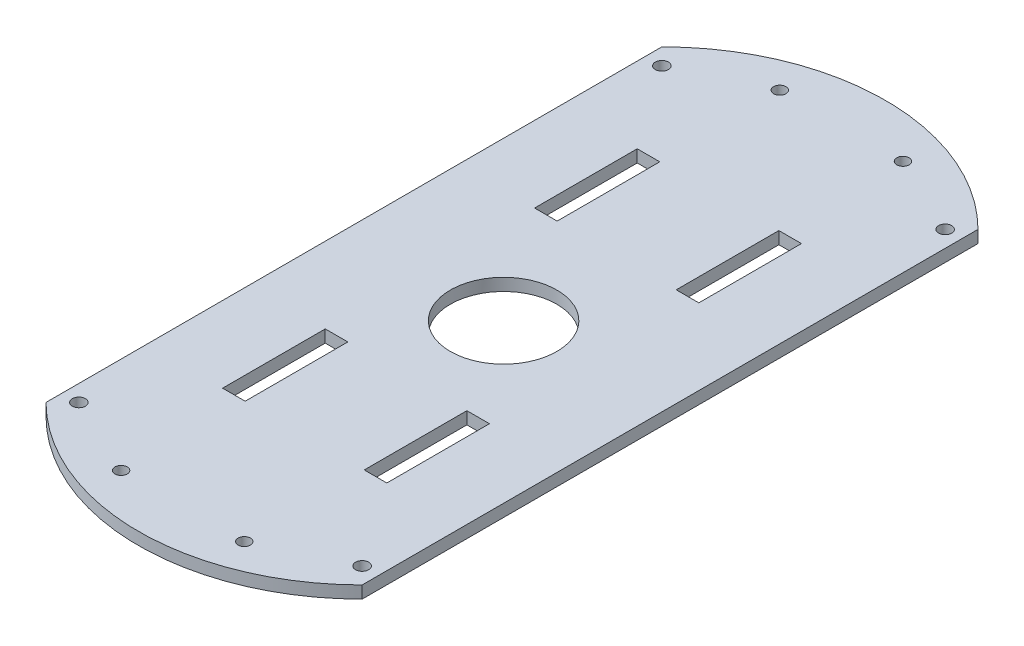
ISO-10303-21;
HEADER;
FILE_DESCRIPTION(('STEP AP214'),'2;1');
FILE_NAME('part.step','',(''),(''),'','','');
FILE_SCHEMA(('AUTOMOTIVE_DESIGN { 1 0 10303 214 1 1 1 1 }'));
ENDSEC;
DATA;
#1=APPLICATION_CONTEXT('core data for automotive mechanical design processes');
#2=APPLICATION_PROTOCOL_DEFINITION('international standard','automotive_design',2000,#1);
#3=PRODUCT_CONTEXT('',#1,'mechanical');
#4=PRODUCT('Part','Part','',(#3));
#5=PRODUCT_RELATED_PRODUCT_CATEGORY('part','',(#4));
#6=PRODUCT_DEFINITION_FORMATION('','',#4);
#7=PRODUCT_DEFINITION_CONTEXT('part definition',#1,'design');
#8=PRODUCT_DEFINITION('design','',#6,#7);
#9=PRODUCT_DEFINITION_SHAPE('','',#8);
#10=(LENGTH_UNIT() NAMED_UNIT(*) SI_UNIT(.MILLI.,.METRE.));
#11=(NAMED_UNIT(*) PLANE_ANGLE_UNIT() SI_UNIT($,.RADIAN.));
#12=(NAMED_UNIT(*) SI_UNIT($,.STERADIAN.) SOLID_ANGLE_UNIT());
#13=UNCERTAINTY_MEASURE_WITH_UNIT(LENGTH_MEASURE(1.E-05),#10,'distance_accuracy_value','');
#14=(GEOMETRIC_REPRESENTATION_CONTEXT(3) GLOBAL_UNCERTAINTY_ASSIGNED_CONTEXT((#13)) GLOBAL_UNIT_ASSIGNED_CONTEXT((#10,
#11,#12)) REPRESENTATION_CONTEXT('',''));
#15=CARTESIAN_POINT('',(0.,0.,0.));
#16=DIRECTION('',(0.,0.,1.));
#17=DIRECTION('',(1.,0.,0.));
#18=AXIS2_PLACEMENT_3D('',#15,#16,#17);
#19=CARTESIAN_POINT('',(38.5,3.,38.5000000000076));
#20=DIRECTION('',(0.,-1.,0.));
#21=DIRECTION('',(0.,0.,-1.));
#22=AXIS2_PLACEMENT_3D('',#19,#20,#21);
#23=CYLINDRICAL_SURFACE('',#22,54.4472221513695);
#24=CARTESIAN_POINT('',(38.5,0.,38.5000000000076));
#25=DIRECTION('',(0.,1.,0.));
#26=DIRECTION('',(0.,0.,-1.));
#27=AXIS2_PLACEMENT_3D('',#24,#25,#26);
#28=CIRCLE('',#27,54.4472221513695);
#29=CARTESIAN_POINT('',(77.,0.,0.));
#30=VERTEX_POINT('',#29);
#31=CARTESIAN_POINT('',(0.,0.,0.));
#32=VERTEX_POINT('',#31);
#33=EDGE_CURVE('E305',#30,#32,#28,.T.);
#34=ORIENTED_EDGE('',*,*,#33,.T.);
#35=DIRECTION('',(0.,-1.,0.));
#36=VECTOR('',#35,1.);
#37=CARTESIAN_POINT('',(0.,3.,0.));
#38=LINE('',#37,#36);
#39=CARTESIAN_POINT('',(0.,3.,0.));
#40=VERTEX_POINT('',#39);
#41=EDGE_CURVE('E321',#40,#32,#38,.T.);
#42=ORIENTED_EDGE('',*,*,#41,.F.);
#43=CARTESIAN_POINT('',(38.5,3.,38.5000000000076));
#44=DIRECTION('',(0.,1.,0.));
#45=DIRECTION('',(0.,0.,-1.));
#46=AXIS2_PLACEMENT_3D('',#43,#44,#45);
#47=CIRCLE('',#46,54.4472221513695);
#48=CARTESIAN_POINT('',(77.,3.,0.));
#49=VERTEX_POINT('',#48);
#50=EDGE_CURVE('E294',#49,#40,#47,.T.);
#51=ORIENTED_EDGE('',*,*,#50,.F.);
#52=DIRECTION('',(0.,-1.,0.));
#53=VECTOR('',#52,1.);
#54=CARTESIAN_POINT('',(77.,3.,0.));
#55=LINE('',#54,#53);
#56=EDGE_CURVE('E304',#49,#30,#55,.T.);
#57=ORIENTED_EDGE('',*,*,#56,.T.);
#58=EDGE_LOOP('',(#34,#42,#51,#57));
#59=FACE_BOUND('',#58,.T.);
#60=ADVANCED_FACE('F33',(#59),#23,.T.);
#61=CARTESIAN_POINT('',(0.,3.,0.));
#62=DIRECTION('',(1.,0.,0.));
#63=DIRECTION('',(0.,0.,-1.));
#64=AXIS2_PLACEMENT_3D('',#61,#62,#63);
#65=PLANE('',#64);
#66=DIRECTION('',(0.,0.,1.));
#67=VECTOR('',#66,1.);
#68=CARTESIAN_POINT('',(0.,0.,0.));
#69=LINE('',#68,#67);
#70=CARTESIAN_POINT('',(0.,0.,150.));
#71=VERTEX_POINT('',#70);
#72=EDGE_CURVE('E308',#32,#71,#69,.T.);
#73=ORIENTED_EDGE('',*,*,#72,.T.);
#74=DIRECTION('',(0.,-1.,0.));
#75=VECTOR('',#74,1.);
#76=CARTESIAN_POINT('',(0.,3.,150.));
#77=LINE('',#76,#75);
#78=CARTESIAN_POINT('',(0.,3.,150.));
#79=VERTEX_POINT('',#78);
#80=EDGE_CURVE('E318',#79,#71,#77,.T.);
#81=ORIENTED_EDGE('',*,*,#80,.F.);
#82=DIRECTION('',(0.,0.,1.));
#83=VECTOR('',#82,1.);
#84=CARTESIAN_POINT('',(0.,3.,0.));
#85=LINE('',#84,#83);
#86=EDGE_CURVE('E297',#40,#79,#85,.T.);
#87=ORIENTED_EDGE('',*,*,#86,.F.);
#88=ORIENTED_EDGE('',*,*,#41,.T.);
#89=EDGE_LOOP('',(#73,#81,#87,#88));
#90=FACE_BOUND('',#89,.T.);
#91=ADVANCED_FACE('F429',(#90),#65,.F.);
#92=CARTESIAN_POINT('',(38.5,3.,111.5));
#93=DIRECTION('',(0.,-1.,0.));
#94=DIRECTION('',(0.,0.,-1.));
#95=AXIS2_PLACEMENT_3D('',#92,#93,#94);
#96=CYLINDRICAL_SURFACE('',#95,54.4472221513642);
#97=CARTESIAN_POINT('',(38.5,0.,111.5));
#98=DIRECTION('',(0.,1.,0.));
#99=DIRECTION('',(0.,0.,-1.));
#100=AXIS2_PLACEMENT_3D('',#97,#98,#99);
#101=CIRCLE('',#100,54.4472221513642);
#102=CARTESIAN_POINT('',(77.,0.,150.));
#103=VERTEX_POINT('',#102);
#104=EDGE_CURVE('E310',#71,#103,#101,.T.);
#105=ORIENTED_EDGE('',*,*,#104,.T.);
#106=DIRECTION('',(0.,-1.,0.));
#107=VECTOR('',#106,1.);
#108=CARTESIAN_POINT('',(77.,3.,150.));
#109=LINE('',#108,#107);
#110=CARTESIAN_POINT('',(77.,3.,150.));
#111=VERTEX_POINT('',#110);
#112=EDGE_CURVE('E315',#111,#103,#109,.T.);
#113=ORIENTED_EDGE('',*,*,#112,.F.);
#114=CARTESIAN_POINT('',(38.5,3.,111.5));
#115=DIRECTION('',(0.,1.,0.));
#116=DIRECTION('',(0.,0.,-1.));
#117=AXIS2_PLACEMENT_3D('',#114,#115,#116);
#118=CIRCLE('',#117,54.4472221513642);
#119=EDGE_CURVE('E300',#79,#111,#118,.T.);
#120=ORIENTED_EDGE('',*,*,#119,.F.);
#121=ORIENTED_EDGE('',*,*,#80,.T.);
#122=EDGE_LOOP('',(#105,#113,#120,#121));
#123=FACE_BOUND('',#122,.T.);
#124=ADVANCED_FACE('F434',(#123),#96,.T.);
#125=CARTESIAN_POINT('',(77.,3.,0.));
#126=DIRECTION('',(-1.,0.,0.));
#127=DIRECTION('',(0.,0.,1.));
#128=AXIS2_PLACEMENT_3D('',#125,#126,#127);
#129=PLANE('',#128);
#130=DIRECTION('',(0.,0.,-1.));
#131=VECTOR('',#130,1.);
#132=CARTESIAN_POINT('',(77.,0.,0.));
#133=LINE('',#132,#131);
#134=EDGE_CURVE('E298',#103,#30,#133,.T.);
#135=ORIENTED_EDGE('',*,*,#134,.T.);
#136=ORIENTED_EDGE('',*,*,#56,.F.);
#137=DIRECTION('',(0.,0.,-1.));
#138=VECTOR('',#137,1.);
#139=CARTESIAN_POINT('',(77.,3.,0.));
#140=LINE('',#139,#138);
#141=EDGE_CURVE('E302',#111,#49,#140,.T.);
#142=ORIENTED_EDGE('',*,*,#141,.F.);
#143=ORIENTED_EDGE('',*,*,#112,.T.);
#144=EDGE_LOOP('',(#135,#136,#142,#143));
#145=FACE_BOUND('',#144,.T.);
#146=ADVANCED_FACE('F394',(#145),#129,.F.);
#147=CARTESIAN_POINT('',(38.5,3.,38.5000000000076));
#148=DIRECTION('',(0.,-1.,0.));
#149=DIRECTION('',(0.,0.,-1.));
#150=AXIS2_PLACEMENT_3D('',#147,#148,#149);
#151=PLANE('',#150);
#152=DIRECTION('',(1.,0.,0.));
#153=VECTOR('',#152,1.);
#154=CARTESIAN_POINT('',(53.,3.,125.49));
#155=LINE('',#154,#153);
#156=CARTESIAN_POINT('',(53.,3.,125.49));
#157=VERTEX_POINT('',#156);
#158=CARTESIAN_POINT('',(58.5,3.,125.49));
#159=VERTEX_POINT('',#158);
#160=EDGE_CURVE('E196',#157,#159,#155,.T.);
#161=ORIENTED_EDGE('',*,*,#160,.F.);
#162=DIRECTION('',(0.,0.,1.));
#163=VECTOR('',#162,1.);
#164=CARTESIAN_POINT('',(53.,3.,125.49));
#165=LINE('',#164,#163);
#166=CARTESIAN_POINT('',(53.,3.,100.49));
#167=VERTEX_POINT('',#166);
#168=EDGE_CURVE('E48',#167,#157,#165,.T.);
#169=ORIENTED_EDGE('',*,*,#168,.F.);
#170=DIRECTION('',(-1.,0.,0.));
#171=VECTOR('',#170,1.);
#172=CARTESIAN_POINT('',(53.,3.,100.49));
#173=LINE('',#172,#171);
#174=CARTESIAN_POINT('',(58.5,3.,100.49));
#175=VERTEX_POINT('',#174);
#176=EDGE_CURVE('E187',#175,#167,#173,.T.);
#177=ORIENTED_EDGE('',*,*,#176,.F.);
#178=DIRECTION('',(0.,0.,-1.));
#179=VECTOR('',#178,1.);
#180=CARTESIAN_POINT('',(58.5,3.,125.49));
#181=LINE('',#180,#179);
#182=EDGE_CURVE('E190',#159,#175,#181,.T.);
#183=ORIENTED_EDGE('',*,*,#182,.F.);
#184=EDGE_LOOP('',(#161,#169,#177,#183));
#185=FACE_BOUND('',#184,.T.);
#186=CARTESIAN_POINT('',(23.5,3.,-5.21799999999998));
#187=DIRECTION('',(0.,1.,0.));
#188=DIRECTION('',(0.,0.,1.));
#189=AXIS2_PLACEMENT_3D('',#186,#187,#188);
#190=CIRCLE('',#189,1.5);
#191=CARTESIAN_POINT('',(23.5,3.,-3.71799999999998));
#192=VERTEX_POINT('',#191);
#193=EDGE_CURVE('E209',#192,#192,#190,.T.);
#194=ORIENTED_EDGE('',*,*,#193,.F.);
#195=EDGE_LOOP('',(#194));
#196=FACE_BOUND('',#195,.T.);
#197=DIRECTION('',(1.,0.,0.));
#198=VECTOR('',#197,1.);
#199=CARTESIAN_POINT('',(18.5,3.,125.49));
#200=LINE('',#199,#198);
#201=CARTESIAN_POINT('',(18.5,3.,125.49));
#202=VERTEX_POINT('',#201);
#203=CARTESIAN_POINT('',(24.,3.,125.49));
#204=VERTEX_POINT('',#203);
#205=EDGE_CURVE('E219',#202,#204,#200,.T.);
#206=ORIENTED_EDGE('',*,*,#205,.F.);
#207=DIRECTION('',(0.,0.,1.));
#208=VECTOR('',#207,1.);
#209=CARTESIAN_POINT('',(18.5,3.,100.49));
#210=LINE('',#209,#208);
#211=CARTESIAN_POINT('',(18.5,3.,100.49));
#212=VERTEX_POINT('',#211);
#213=EDGE_CURVE('E217',#212,#202,#210,.T.);
#214=ORIENTED_EDGE('',*,*,#213,.F.);
#215=DIRECTION('',(-1.,0.,0.));
#216=VECTOR('',#215,1.);
#217=CARTESIAN_POINT('',(18.5,3.,100.49));
#218=LINE('',#217,#216);
#219=CARTESIAN_POINT('',(24.,3.,100.49));
#220=VERTEX_POINT('',#219);
#221=EDGE_CURVE('E225',#220,#212,#218,.T.);
#222=ORIENTED_EDGE('',*,*,#221,.F.);
#223=DIRECTION('',(0.,0.,-1.));
#224=VECTOR('',#223,1.);
#225=CARTESIAN_POINT('',(24.,3.,100.49));
#226=LINE('',#225,#224);
#227=EDGE_CURVE('E222',#204,#220,#226,.T.);
#228=ORIENTED_EDGE('',*,*,#227,.F.);
#229=EDGE_LOOP('',(#206,#214,#222,#228));
#230=FACE_BOUND('',#229,.T.);
#231=CARTESIAN_POINT('',(53.5,3.,-5.21799999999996));
#232=DIRECTION('',(0.,1.,0.));
#233=DIRECTION('',(0.,0.,1.));
#234=AXIS2_PLACEMENT_3D('',#231,#232,#233);
#235=CIRCLE('',#234,1.5);
#236=CARTESIAN_POINT('',(53.5,3.,-3.71799999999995));
#237=VERTEX_POINT('',#236);
#238=EDGE_CURVE('E206',#237,#237,#235,.T.);
#239=ORIENTED_EDGE('',*,*,#238,.F.);
#240=EDGE_LOOP('',(#239));
#241=FACE_BOUND('',#240,.T.);
#242=CARTESIAN_POINT('',(23.5,3.,155.208));
#243=DIRECTION('',(0.,1.,0.));
#244=DIRECTION('',(0.,0.,1.));
#245=AXIS2_PLACEMENT_3D('',#242,#243,#244);
#246=CIRCLE('',#245,1.5);
#247=CARTESIAN_POINT('',(23.5,3.,156.708));
#248=VERTEX_POINT('',#247);
#249=EDGE_CURVE('E210',#248,#248,#246,.T.);
#250=ORIENTED_EDGE('',*,*,#249,.F.);
#251=EDGE_LOOP('',(#250));
#252=FACE_BOUND('',#251,.T.);
#253=CARTESIAN_POINT('',(53.5,3.,155.208));
#254=DIRECTION('',(0.,1.,0.));
#255=DIRECTION('',(0.,0.,1.));
#256=AXIS2_PLACEMENT_3D('',#253,#254,#255);
#257=CIRCLE('',#256,1.5);
#258=CARTESIAN_POINT('',(53.5,3.,156.708));
#259=VERTEX_POINT('',#258);
#260=EDGE_CURVE('E202',#259,#259,#257,.T.);
#261=ORIENTED_EDGE('',*,*,#260,.F.);
#262=EDGE_LOOP('',(#261));
#263=FACE_BOUND('',#262,.T.);
#264=CARTESIAN_POINT('',(4.,3.,146.));
#265=DIRECTION('',(0.,1.,0.));
#266=DIRECTION('',(0.,0.,1.));
#267=AXIS2_PLACEMENT_3D('',#264,#265,#266);
#268=CIRCLE('',#267,1.6);
#269=CARTESIAN_POINT('',(4.,3.,147.6));
#270=VERTEX_POINT('',#269);
#271=EDGE_CURVE('E241',#270,#270,#268,.T.);
#272=ORIENTED_EDGE('',*,*,#271,.F.);
#273=EDGE_LOOP('',(#272));
#274=FACE_BOUND('',#273,.T.);
#275=CARTESIAN_POINT('',(73.,3.,4.));
#276=DIRECTION('',(0.,1.,0.));
#277=DIRECTION('',(0.,0.,1.));
#278=AXIS2_PLACEMENT_3D('',#275,#276,#277);
#279=CIRCLE('',#278,1.60000000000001);
#280=CARTESIAN_POINT('',(73.,3.,5.6));
#281=VERTEX_POINT('',#280);
#282=EDGE_CURVE('E281',#281,#281,#279,.T.);
#283=ORIENTED_EDGE('',*,*,#282,.F.);
#284=EDGE_LOOP('',(#283));
#285=FACE_BOUND('',#284,.T.);
#286=CARTESIAN_POINT('',(4.,3.,4.));
#287=DIRECTION('',(0.,1.,0.));
#288=DIRECTION('',(0.,0.,1.));
#289=AXIS2_PLACEMENT_3D('',#286,#287,#288);
#290=CIRCLE('',#289,1.6);
#291=CARTESIAN_POINT('',(4.,3.,5.6));
#292=VERTEX_POINT('',#291);
#293=EDGE_CURVE('E284',#292,#292,#290,.T.);
#294=ORIENTED_EDGE('',*,*,#293,.F.);
#295=EDGE_LOOP('',(#294));
#296=FACE_BOUND('',#295,.T.);
#297=CARTESIAN_POINT('',(73.,3.,146.));
#298=DIRECTION('',(0.,1.,0.));
#299=DIRECTION('',(0.,0.,1.));
#300=AXIS2_PLACEMENT_3D('',#297,#298,#299);
#301=CIRCLE('',#300,1.6);
#302=CARTESIAN_POINT('',(73.,3.,147.6));
#303=VERTEX_POINT('',#302);
#304=EDGE_CURVE('E238',#303,#303,#301,.T.);
#305=ORIENTED_EDGE('',*,*,#304,.F.);
#306=EDGE_LOOP('',(#305));
#307=FACE_BOUND('',#306,.T.);
#308=DIRECTION('',(1.,0.,0.));
#309=VECTOR('',#308,1.);
#310=CARTESIAN_POINT('',(18.5,3.,49.5));
#311=LINE('',#310,#309);
#312=CARTESIAN_POINT('',(18.5,3.,49.5));
#313=VERTEX_POINT('',#312);
#314=CARTESIAN_POINT('',(24.,3.,49.5));
#315=VERTEX_POINT('',#314);
#316=EDGE_CURVE('E245',#313,#315,#311,.T.);
#317=ORIENTED_EDGE('',*,*,#316,.F.);
#318=DIRECTION('',(0.,0.,1.));
#319=VECTOR('',#318,1.);
#320=CARTESIAN_POINT('',(18.5,3.,24.5));
#321=LINE('',#320,#319);
#322=CARTESIAN_POINT('',(18.5,3.,24.5));
#323=VERTEX_POINT('',#322);
#324=EDGE_CURVE('E243',#323,#313,#321,.T.);
#325=ORIENTED_EDGE('',*,*,#324,.F.);
#326=DIRECTION('',(-1.,0.,0.));
#327=VECTOR('',#326,1.);
#328=CARTESIAN_POINT('',(18.5,3.,24.5));
#329=LINE('',#328,#327);
#330=CARTESIAN_POINT('',(24.,3.,24.5));
#331=VERTEX_POINT('',#330);
#332=EDGE_CURVE('E252',#331,#323,#329,.T.);
#333=ORIENTED_EDGE('',*,*,#332,.F.);
#334=DIRECTION('',(0.,0.,-1.));
#335=VECTOR('',#334,1.);
#336=CARTESIAN_POINT('',(24.,3.,24.5));
#337=LINE('',#336,#335);
#338=EDGE_CURVE('E249',#315,#331,#337,.T.);
#339=ORIENTED_EDGE('',*,*,#338,.F.);
#340=EDGE_LOOP('',(#317,#325,#333,#339));
#341=FACE_BOUND('',#340,.T.);
#342=DIRECTION('',(-1.,0.,0.));
#343=VECTOR('',#342,1.);
#344=CARTESIAN_POINT('',(58.5,3.,24.5));
#345=LINE('',#344,#343);
#346=CARTESIAN_POINT('',(58.5,3.,24.5));
#347=VERTEX_POINT('',#346);
#348=CARTESIAN_POINT('',(53.,3.,24.5));
#349=VERTEX_POINT('',#348);
#350=EDGE_CURVE('E264',#347,#349,#345,.T.);
#351=ORIENTED_EDGE('',*,*,#350,.F.);
#352=DIRECTION('',(0.,0.,-1.));
#353=VECTOR('',#352,1.);
#354=CARTESIAN_POINT('',(58.5,3.,24.5));
#355=LINE('',#354,#353);
#356=CARTESIAN_POINT('',(58.5,3.,49.5));
#357=VERTEX_POINT('',#356);
#358=EDGE_CURVE('E231',#357,#347,#355,.T.);
#359=ORIENTED_EDGE('',*,*,#358,.F.);
#360=DIRECTION('',(1.,0.,0.));
#361=VECTOR('',#360,1.);
#362=CARTESIAN_POINT('',(58.5,3.,49.5));
#363=LINE('',#362,#361);
#364=CARTESIAN_POINT('',(53.,3.,49.5));
#365=VERTEX_POINT('',#364);
#366=EDGE_CURVE('E270',#365,#357,#363,.T.);
#367=ORIENTED_EDGE('',*,*,#366,.F.);
#368=DIRECTION('',(0.,0.,1.));
#369=VECTOR('',#368,1.);
#370=CARTESIAN_POINT('',(53.,3.,24.5));
#371=LINE('',#370,#369);
#372=EDGE_CURVE('E267',#349,#365,#371,.T.);
#373=ORIENTED_EDGE('',*,*,#372,.F.);
#374=EDGE_LOOP('',(#351,#359,#367,#373));
#375=FACE_BOUND('',#374,.T.);
#376=CARTESIAN_POINT('',(38.5,3.,77.0475249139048));
#377=DIRECTION('',(0.,1.,0.));
#378=DIRECTION('',(0.,0.,1.));
#379=AXIS2_PLACEMENT_3D('',#376,#377,#378);
#380=CIRCLE('',#379,12.967360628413);
#381=CARTESIAN_POINT('',(38.5,3.,90.0148855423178));
#382=VERTEX_POINT('',#381);
#383=EDGE_CURVE('E290',#382,#382,#380,.T.);
#384=ORIENTED_EDGE('',*,*,#383,.F.);
#385=EDGE_LOOP('',(#384));
#386=FACE_BOUND('',#385,.T.);
#387=ORIENTED_EDGE('',*,*,#50,.T.);
#388=ORIENTED_EDGE('',*,*,#86,.T.);
#389=ORIENTED_EDGE('',*,*,#119,.T.);
#390=ORIENTED_EDGE('',*,*,#141,.T.);
#391=EDGE_LOOP('',(#387,#388,#389,#390));
#392=FACE_BOUND('',#391,.T.);
#393=ADVANCED_FACE('F391',(#185,#196,#230,#241,#252,#263,#274,#285,#296,#307,#341,#375,#386,
#392),#151,.F.);
#394=CARTESIAN_POINT('',(38.5,0.,38.5000000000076));
#395=DIRECTION('',(0.,-1.,0.));
#396=DIRECTION('',(0.,0.,-1.));
#397=AXIS2_PLACEMENT_3D('',#394,#395,#396);
#398=PLANE('',#397);
#399=DIRECTION('',(0.,0.,1.));
#400=VECTOR('',#399,1.);
#401=CARTESIAN_POINT('',(53.,0.,125.49));
#402=LINE('',#401,#400);
#403=CARTESIAN_POINT('',(53.,0.,100.49));
#404=VERTEX_POINT('',#403);
#405=CARTESIAN_POINT('',(53.,0.,125.49));
#406=VERTEX_POINT('',#405);
#407=EDGE_CURVE('E171',#404,#406,#402,.T.);
#408=ORIENTED_EDGE('',*,*,#407,.T.);
#409=DIRECTION('',(1.,0.,0.));
#410=VECTOR('',#409,1.);
#411=CARTESIAN_POINT('',(53.,0.,125.49));
#412=LINE('',#411,#410);
#413=CARTESIAN_POINT('',(58.5,0.,125.49));
#414=VERTEX_POINT('',#413);
#415=EDGE_CURVE('E180',#406,#414,#412,.T.);
#416=ORIENTED_EDGE('',*,*,#415,.T.);
#417=DIRECTION('',(0.,0.,-1.));
#418=VECTOR('',#417,1.);
#419=CARTESIAN_POINT('',(58.5,0.,125.49));
#420=LINE('',#419,#418);
#421=CARTESIAN_POINT('',(58.5,0.,100.49));
#422=VERTEX_POINT('',#421);
#423=EDGE_CURVE('E56',#414,#422,#420,.T.);
#424=ORIENTED_EDGE('',*,*,#423,.T.);
#425=DIRECTION('',(-1.,0.,0.));
#426=VECTOR('',#425,1.);
#427=CARTESIAN_POINT('',(53.,0.,100.49));
#428=LINE('',#427,#426);
#429=EDGE_CURVE('E177',#422,#404,#428,.T.);
#430=ORIENTED_EDGE('',*,*,#429,.T.);
#431=EDGE_LOOP('',(#408,#416,#424,#430));
#432=FACE_BOUND('',#431,.T.);
#433=CARTESIAN_POINT('',(23.5,0.,-5.21799999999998));
#434=DIRECTION('',(0.,-1.,0.));
#435=DIRECTION('',(0.,0.,-1.));
#436=AXIS2_PLACEMENT_3D('',#433,#434,#435);
#437=CIRCLE('',#436,1.5);
#438=CARTESIAN_POINT('',(23.5,0.,-6.71799999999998));
#439=VERTEX_POINT('',#438);
#440=EDGE_CURVE('E36',#439,#439,#437,.T.);
#441=ORIENTED_EDGE('',*,*,#440,.F.);
#442=EDGE_LOOP('',(#441));
#443=FACE_BOUND('',#442,.T.);
#444=DIRECTION('',(0.,0.,-1.));
#445=VECTOR('',#444,1.);
#446=CARTESIAN_POINT('',(18.5,0.,38.5000000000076));
#447=LINE('',#446,#445);
#448=CARTESIAN_POINT('',(18.5,0.,125.49));
#449=VERTEX_POINT('',#448);
#450=CARTESIAN_POINT('',(18.5,0.,100.49));
#451=VERTEX_POINT('',#450);
#452=EDGE_CURVE('E11',#449,#451,#447,.T.);
#453=ORIENTED_EDGE('',*,*,#452,.F.);
#454=DIRECTION('',(-1.,0.,0.));
#455=VECTOR('',#454,1.);
#456=CARTESIAN_POINT('',(38.5,0.,125.49));
#457=LINE('',#456,#455);
#458=CARTESIAN_POINT('',(24.,0.,125.49));
#459=VERTEX_POINT('',#458);
#460=EDGE_CURVE('E344',#459,#449,#457,.T.);
#461=ORIENTED_EDGE('',*,*,#460,.F.);
#462=DIRECTION('',(0.,0.,1.));
#463=VECTOR('',#462,1.);
#464=CARTESIAN_POINT('',(24.,0.,38.5000000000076));
#465=LINE('',#464,#463);
#466=CARTESIAN_POINT('',(24.,0.,100.49));
#467=VERTEX_POINT('',#466);
#468=EDGE_CURVE('E366',#467,#459,#465,.T.);
#469=ORIENTED_EDGE('',*,*,#468,.F.);
#470=DIRECTION('',(1.,0.,0.));
#471=VECTOR('',#470,1.);
#472=CARTESIAN_POINT('',(38.5,0.,100.49));
#473=LINE('',#472,#471);
#474=EDGE_CURVE('E41',#451,#467,#473,.T.);
#475=ORIENTED_EDGE('',*,*,#474,.F.);
#476=EDGE_LOOP('',(#453,#461,#469,#475));
#477=FACE_BOUND('',#476,.T.);
#478=CARTESIAN_POINT('',(53.5,0.,-5.21799999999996));
#479=DIRECTION('',(0.,-1.,0.));
#480=DIRECTION('',(0.,0.,-1.));
#481=AXIS2_PLACEMENT_3D('',#478,#479,#480);
#482=CIRCLE('',#481,1.5);
#483=CARTESIAN_POINT('',(53.5,0.,-6.71799999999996));
#484=VERTEX_POINT('',#483);
#485=EDGE_CURVE('E362',#484,#484,#482,.T.);
#486=ORIENTED_EDGE('',*,*,#485,.F.);
#487=EDGE_LOOP('',(#486));
#488=FACE_BOUND('',#487,.T.);
#489=CARTESIAN_POINT('',(23.5,0.,155.208));
#490=DIRECTION('',(0.,-1.,0.));
#491=DIRECTION('',(0.,0.,-1.));
#492=AXIS2_PLACEMENT_3D('',#489,#490,#491);
#493=CIRCLE('',#492,1.5);
#494=CARTESIAN_POINT('',(23.5,0.,153.708));
#495=VERTEX_POINT('',#494);
#496=EDGE_CURVE('E359',#495,#495,#493,.T.);
#497=ORIENTED_EDGE('',*,*,#496,.F.);
#498=EDGE_LOOP('',(#497));
#499=FACE_BOUND('',#498,.T.);
#500=CARTESIAN_POINT('',(53.5,0.,155.208));
#501=DIRECTION('',(0.,-1.,0.));
#502=DIRECTION('',(0.,0.,-1.));
#503=AXIS2_PLACEMENT_3D('',#500,#501,#502);
#504=CIRCLE('',#503,1.5);
#505=CARTESIAN_POINT('',(53.5,0.,153.708));
#506=VERTEX_POINT('',#505);
#507=EDGE_CURVE('E356',#506,#506,#504,.T.);
#508=ORIENTED_EDGE('',*,*,#507,.F.);
#509=EDGE_LOOP('',(#508));
#510=FACE_BOUND('',#509,.T.);
#511=CARTESIAN_POINT('',(4.,0.,146.));
#512=DIRECTION('',(0.,-1.,0.));
#513=DIRECTION('',(0.,0.,-1.));
#514=AXIS2_PLACEMENT_3D('',#511,#512,#513);
#515=CIRCLE('',#514,1.6);
#516=CARTESIAN_POINT('',(4.,0.,144.4));
#517=VERTEX_POINT('',#516);
#518=EDGE_CURVE('E353',#517,#517,#515,.T.);
#519=ORIENTED_EDGE('',*,*,#518,.F.);
#520=EDGE_LOOP('',(#519));
#521=FACE_BOUND('',#520,.T.);
#522=CARTESIAN_POINT('',(73.,0.,4.));
#523=DIRECTION('',(0.,-1.,0.));
#524=DIRECTION('',(0.,0.,-1.));
#525=AXIS2_PLACEMENT_3D('',#522,#523,#524);
#526=CIRCLE('',#525,1.60000000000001);
#527=CARTESIAN_POINT('',(73.,0.,2.4));
#528=VERTEX_POINT('',#527);
#529=EDGE_CURVE('E350',#528,#528,#526,.T.);
#530=ORIENTED_EDGE('',*,*,#529,.F.);
#531=EDGE_LOOP('',(#530));
#532=FACE_BOUND('',#531,.T.);
#533=CARTESIAN_POINT('',(4.,0.,4.));
#534=DIRECTION('',(0.,-1.,0.));
#535=DIRECTION('',(0.,0.,-1.));
#536=AXIS2_PLACEMENT_3D('',#533,#534,#535);
#537=CIRCLE('',#536,1.6);
#538=CARTESIAN_POINT('',(4.,0.,2.4));
#539=VERTEX_POINT('',#538);
#540=EDGE_CURVE('E347',#539,#539,#537,.T.);
#541=ORIENTED_EDGE('',*,*,#540,.F.);
#542=EDGE_LOOP('',(#541));
#543=FACE_BOUND('',#542,.T.);
#544=CARTESIAN_POINT('',(73.,0.,146.));
#545=DIRECTION('',(0.,-1.,0.));
#546=DIRECTION('',(0.,0.,-1.));
#547=AXIS2_PLACEMENT_3D('',#544,#545,#546);
#548=CIRCLE('',#547,1.6);
#549=CARTESIAN_POINT('',(73.,0.,144.4));
#550=VERTEX_POINT('',#549);
#551=EDGE_CURVE('E289',#550,#550,#548,.T.);
#552=ORIENTED_EDGE('',*,*,#551,.F.);
#553=EDGE_LOOP('',(#552));
#554=FACE_BOUND('',#553,.T.);
#555=DIRECTION('',(0.,0.,-1.));
#556=VECTOR('',#555,1.);
#557=CARTESIAN_POINT('',(18.5,0.,38.5000000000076));
#558=LINE('',#557,#556);
#559=CARTESIAN_POINT('',(18.5,0.,49.5));
#560=VERTEX_POINT('',#559);
#561=CARTESIAN_POINT('',(18.5,0.,24.5));
#562=VERTEX_POINT('',#561);
#563=EDGE_CURVE('E342',#560,#562,#558,.T.);
#564=ORIENTED_EDGE('',*,*,#563,.F.);
#565=DIRECTION('',(-1.,0.,0.));
#566=VECTOR('',#565,1.);
#567=CARTESIAN_POINT('',(38.5,0.,49.5));
#568=LINE('',#567,#566);
#569=CARTESIAN_POINT('',(24.,0.,49.5));
#570=VERTEX_POINT('',#569);
#571=EDGE_CURVE('E335',#570,#560,#568,.T.);
#572=ORIENTED_EDGE('',*,*,#571,.F.);
#573=DIRECTION('',(0.,0.,1.));
#574=VECTOR('',#573,1.);
#575=CARTESIAN_POINT('',(24.,0.,38.5000000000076));
#576=LINE('',#575,#574);
#577=CARTESIAN_POINT('',(24.,0.,24.5));
#578=VERTEX_POINT('',#577);
#579=EDGE_CURVE('E337',#578,#570,#576,.T.);
#580=ORIENTED_EDGE('',*,*,#579,.F.);
#581=DIRECTION('',(1.,0.,0.));
#582=VECTOR('',#581,1.);
#583=CARTESIAN_POINT('',(38.5,0.,24.5));
#584=LINE('',#583,#582);
#585=EDGE_CURVE('E340',#562,#578,#584,.T.);
#586=ORIENTED_EDGE('',*,*,#585,.F.);
#587=EDGE_LOOP('',(#564,#572,#580,#586));
#588=FACE_BOUND('',#587,.T.);
#589=DIRECTION('',(0.,0.,1.));
#590=VECTOR('',#589,1.);
#591=CARTESIAN_POINT('',(58.5,0.,38.5000000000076));
#592=LINE('',#591,#590);
#593=CARTESIAN_POINT('',(58.5,0.,24.5));
#594=VERTEX_POINT('',#593);
#595=CARTESIAN_POINT('',(58.5,0.,49.5));
#596=VERTEX_POINT('',#595);
#597=EDGE_CURVE('E333',#594,#596,#592,.T.);
#598=ORIENTED_EDGE('',*,*,#597,.F.);
#599=DIRECTION('',(1.,0.,0.));
#600=VECTOR('',#599,1.);
#601=CARTESIAN_POINT('',(38.5,0.,24.5));
#602=LINE('',#601,#600);
#603=CARTESIAN_POINT('',(53.,0.,24.5));
#604=VERTEX_POINT('',#603);
#605=EDGE_CURVE('E324',#604,#594,#602,.T.);
#606=ORIENTED_EDGE('',*,*,#605,.F.);
#607=DIRECTION('',(0.,0.,-1.));
#608=VECTOR('',#607,1.);
#609=CARTESIAN_POINT('',(53.,0.,38.5000000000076));
#610=LINE('',#609,#608);
#611=CARTESIAN_POINT('',(53.,0.,49.5));
#612=VERTEX_POINT('',#611);
#613=EDGE_CURVE('E328',#612,#604,#610,.T.);
#614=ORIENTED_EDGE('',*,*,#613,.F.);
#615=DIRECTION('',(-1.,0.,0.));
#616=VECTOR('',#615,1.);
#617=CARTESIAN_POINT('',(38.5,0.,49.5));
#618=LINE('',#617,#616);
#619=EDGE_CURVE('E331',#596,#612,#618,.T.);
#620=ORIENTED_EDGE('',*,*,#619,.F.);
#621=EDGE_LOOP('',(#598,#606,#614,#620));
#622=FACE_BOUND('',#621,.T.);
#623=CARTESIAN_POINT('',(38.5,0.,77.0475249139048));
#624=DIRECTION('',(0.,-1.,0.));
#625=DIRECTION('',(0.,0.,-1.));
#626=AXIS2_PLACEMENT_3D('',#623,#624,#625);
#627=CIRCLE('',#626,12.967360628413);
#628=CARTESIAN_POINT('',(38.5,0.,64.0801642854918));
#629=VERTEX_POINT('',#628);
#630=EDGE_CURVE('E293',#629,#629,#627,.T.);
#631=ORIENTED_EDGE('',*,*,#630,.F.);
#632=EDGE_LOOP('',(#631));
#633=FACE_BOUND('',#632,.T.);
#634=ORIENTED_EDGE('',*,*,#33,.F.);
#635=ORIENTED_EDGE('',*,*,#134,.F.);
#636=ORIENTED_EDGE('',*,*,#104,.F.);
#637=ORIENTED_EDGE('',*,*,#72,.F.);
#638=EDGE_LOOP('',(#634,#635,#636,#637));
#639=FACE_BOUND('',#638,.T.);
#640=ADVANCED_FACE('F184',(#432,#443,#477,#488,#499,#510,#521,#532,#543,#554,#588,#622,#633,
#639),#398,.T.);
#641=CARTESIAN_POINT('',(38.5,-98.72,77.0475249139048));
#642=DIRECTION('',(0.,1.,0.));
#643=DIRECTION('',(0.,0.,1.));
#644=AXIS2_PLACEMENT_3D('',#641,#642,#643);
#645=CYLINDRICAL_SURFACE('',#644,12.967360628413);
#646=ORIENTED_EDGE('',*,*,#630,.T.);
#647=EDGE_LOOP('',(#646));
#648=FACE_BOUND('',#647,.T.);
#649=ORIENTED_EDGE('',*,*,#383,.T.);
#650=EDGE_LOOP('',(#649));
#651=FACE_BOUND('',#650,.T.);
#652=ADVANCED_FACE('F439',(#648,#651),#645,.F.);
#653=CARTESIAN_POINT('',(58.5,-98.72,24.5));
#654=DIRECTION('',(1.,0.,0.));
#655=DIRECTION('',(0.,0.,-1.));
#656=AXIS2_PLACEMENT_3D('',#653,#654,#655);
#657=PLANE('',#656);
#658=ORIENTED_EDGE('',*,*,#597,.T.);
#659=DIRECTION('',(0.,1.,0.));
#660=VECTOR('',#659,1.);
#661=CARTESIAN_POINT('',(58.5,-98.72,49.5));
#662=LINE('',#661,#660);
#663=EDGE_CURVE('E246',#596,#357,#662,.T.);
#664=ORIENTED_EDGE('',*,*,#663,.T.);
#665=ORIENTED_EDGE('',*,*,#358,.T.);
#666=DIRECTION('',(0.,1.,0.));
#667=VECTOR('',#666,1.);
#668=CARTESIAN_POINT('',(58.5,-98.72,24.5));
#669=LINE('',#668,#667);
#670=EDGE_CURVE('E273',#594,#347,#669,.T.);
#671=ORIENTED_EDGE('',*,*,#670,.F.);
#672=EDGE_LOOP('',(#658,#664,#665,#671));
#673=FACE_BOUND('',#672,.T.);
#674=ADVANCED_FACE('F444',(#673),#657,.F.);
#675=CARTESIAN_POINT('',(58.5,-98.72,49.5));
#676=DIRECTION('',(0.,0.,1.));
#677=DIRECTION('',(1.,0.,0.));
#678=AXIS2_PLACEMENT_3D('',#675,#676,#677);
#679=PLANE('',#678);
#680=ORIENTED_EDGE('',*,*,#619,.T.);
#681=DIRECTION('',(0.,1.,0.));
#682=VECTOR('',#681,1.);
#683=CARTESIAN_POINT('',(53.,-98.72,49.5));
#684=LINE('',#683,#682);
#685=EDGE_CURVE('E275',#612,#365,#684,.T.);
#686=ORIENTED_EDGE('',*,*,#685,.T.);
#687=ORIENTED_EDGE('',*,*,#366,.T.);
#688=ORIENTED_EDGE('',*,*,#663,.F.);
#689=EDGE_LOOP('',(#680,#686,#687,#688));
#690=FACE_BOUND('',#689,.T.);
#691=ADVANCED_FACE('F563',(#690),#679,.F.);
#692=CARTESIAN_POINT('',(53.,-98.72,24.5));
#693=DIRECTION('',(-1.,0.,0.));
#694=DIRECTION('',(0.,0.,1.));
#695=AXIS2_PLACEMENT_3D('',#692,#693,#694);
#696=PLANE('',#695);
#697=ORIENTED_EDGE('',*,*,#613,.T.);
#698=DIRECTION('',(0.,1.,0.));
#699=VECTOR('',#698,1.);
#700=CARTESIAN_POINT('',(53.,-98.72,24.5));
#701=LINE('',#700,#699);
#702=EDGE_CURVE('E277',#604,#349,#701,.T.);
#703=ORIENTED_EDGE('',*,*,#702,.T.);
#704=ORIENTED_EDGE('',*,*,#372,.T.);
#705=ORIENTED_EDGE('',*,*,#685,.F.);
#706=EDGE_LOOP('',(#697,#703,#704,#705));
#707=FACE_BOUND('',#706,.T.);
#708=ADVANCED_FACE('F566',(#707),#696,.F.);
#709=CARTESIAN_POINT('',(58.5,-98.72,24.5));
#710=DIRECTION('',(0.,0.,-1.));
#711=DIRECTION('',(-1.,0.,0.));
#712=AXIS2_PLACEMENT_3D('',#709,#710,#711);
#713=PLANE('',#712);
#714=ORIENTED_EDGE('',*,*,#605,.T.);
#715=ORIENTED_EDGE('',*,*,#670,.T.);
#716=ORIENTED_EDGE('',*,*,#350,.T.);
#717=ORIENTED_EDGE('',*,*,#702,.F.);
#718=EDGE_LOOP('',(#714,#715,#716,#717));
#719=FACE_BOUND('',#718,.T.);
#720=ADVANCED_FACE('F561',(#719),#713,.F.);
#721=CARTESIAN_POINT('',(18.5,-98.72,24.5));
#722=DIRECTION('',(-1.,0.,0.));
#723=DIRECTION('',(0.,0.,1.));
#724=AXIS2_PLACEMENT_3D('',#721,#722,#723);
#725=PLANE('',#724);
#726=ORIENTED_EDGE('',*,*,#563,.T.);
#727=DIRECTION('',(0.,1.,0.));
#728=VECTOR('',#727,1.);
#729=CARTESIAN_POINT('',(18.5,-98.72,24.5));
#730=LINE('',#729,#728);
#731=EDGE_CURVE('E242',#562,#323,#730,.T.);
#732=ORIENTED_EDGE('',*,*,#731,.T.);
#733=ORIENTED_EDGE('',*,*,#324,.T.);
#734=DIRECTION('',(0.,1.,0.));
#735=VECTOR('',#734,1.);
#736=CARTESIAN_POINT('',(18.5,-98.72,49.5));
#737=LINE('',#736,#735);
#738=EDGE_CURVE('E255',#560,#313,#737,.T.);
#739=ORIENTED_EDGE('',*,*,#738,.F.);
#740=EDGE_LOOP('',(#726,#732,#733,#739));
#741=FACE_BOUND('',#740,.T.);
#742=ADVANCED_FACE('F551',(#741),#725,.F.);
#743=CARTESIAN_POINT('',(18.5,-98.72,24.5));
#744=DIRECTION('',(0.,0.,-1.));
#745=DIRECTION('',(-1.,0.,0.));
#746=AXIS2_PLACEMENT_3D('',#743,#744,#745);
#747=PLANE('',#746);
#748=ORIENTED_EDGE('',*,*,#585,.T.);
#749=DIRECTION('',(0.,1.,0.));
#750=VECTOR('',#749,1.);
#751=CARTESIAN_POINT('',(24.,-98.72,24.5));
#752=LINE('',#751,#750);
#753=EDGE_CURVE('E257',#578,#331,#752,.T.);
#754=ORIENTED_EDGE('',*,*,#753,.T.);
#755=ORIENTED_EDGE('',*,*,#332,.T.);
#756=ORIENTED_EDGE('',*,*,#731,.F.);
#757=EDGE_LOOP('',(#748,#754,#755,#756));
#758=FACE_BOUND('',#757,.T.);
#759=ADVANCED_FACE('F547',(#758),#747,.F.);
#760=CARTESIAN_POINT('',(24.,-98.72,24.5));
#761=DIRECTION('',(1.,0.,0.));
#762=DIRECTION('',(0.,0.,-1.));
#763=AXIS2_PLACEMENT_3D('',#760,#761,#762);
#764=PLANE('',#763);
#765=ORIENTED_EDGE('',*,*,#579,.T.);
#766=DIRECTION('',(0.,1.,0.));
#767=VECTOR('',#766,1.);
#768=CARTESIAN_POINT('',(24.,-98.72,49.5));
#769=LINE('',#768,#767);
#770=EDGE_CURVE('E259',#570,#315,#769,.T.);
#771=ORIENTED_EDGE('',*,*,#770,.T.);
#772=ORIENTED_EDGE('',*,*,#338,.T.);
#773=ORIENTED_EDGE('',*,*,#753,.F.);
#774=EDGE_LOOP('',(#765,#771,#772,#773));
#775=FACE_BOUND('',#774,.T.);
#776=ADVANCED_FACE('F550',(#775),#764,.F.);
#777=CARTESIAN_POINT('',(18.5,-98.72,49.5));
#778=DIRECTION('',(0.,0.,1.));
#779=DIRECTION('',(1.,0.,0.));
#780=AXIS2_PLACEMENT_3D('',#777,#778,#779);
#781=PLANE('',#780);
#782=ORIENTED_EDGE('',*,*,#571,.T.);
#783=ORIENTED_EDGE('',*,*,#738,.T.);
#784=ORIENTED_EDGE('',*,*,#316,.T.);
#785=ORIENTED_EDGE('',*,*,#770,.F.);
#786=EDGE_LOOP('',(#782,#783,#784,#785));
#787=FACE_BOUND('',#786,.T.);
#788=ADVANCED_FACE('F545',(#787),#781,.F.);
#789=CARTESIAN_POINT('',(73.,-98.72,146.));
#790=DIRECTION('',(0.,1.,0.));
#791=DIRECTION('',(0.,0.,1.));
#792=AXIS2_PLACEMENT_3D('',#789,#790,#791);
#793=CYLINDRICAL_SURFACE('',#792,1.6);
#794=ORIENTED_EDGE('',*,*,#551,.T.);
#795=EDGE_LOOP('',(#794));
#796=FACE_BOUND('',#795,.T.);
#797=ORIENTED_EDGE('',*,*,#304,.T.);
#798=EDGE_LOOP('',(#797));
#799=FACE_BOUND('',#798,.T.);
#800=ADVANCED_FACE('F541',(#796,#799),#793,.F.);
#801=CARTESIAN_POINT('',(4.,-98.72,4.));
#802=DIRECTION('',(0.,1.,0.));
#803=DIRECTION('',(0.,0.,1.));
#804=AXIS2_PLACEMENT_3D('',#801,#802,#803);
#805=CYLINDRICAL_SURFACE('',#804,1.6);
#806=ORIENTED_EDGE('',*,*,#540,.T.);
#807=EDGE_LOOP('',(#806));
#808=FACE_BOUND('',#807,.T.);
#809=ORIENTED_EDGE('',*,*,#293,.T.);
#810=EDGE_LOOP('',(#809));
#811=FACE_BOUND('',#810,.T.);
#812=ADVANCED_FACE('F544',(#808,#811),#805,.F.);
#813=CARTESIAN_POINT('',(73.,-98.72,4.));
#814=DIRECTION('',(0.,1.,0.));
#815=DIRECTION('',(0.,0.,1.));
#816=AXIS2_PLACEMENT_3D('',#813,#814,#815);
#817=CYLINDRICAL_SURFACE('',#816,1.60000000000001);
#818=ORIENTED_EDGE('',*,*,#529,.T.);
#819=EDGE_LOOP('',(#818));
#820=FACE_BOUND('',#819,.T.);
#821=ORIENTED_EDGE('',*,*,#282,.T.);
#822=EDGE_LOOP('',(#821));
#823=FACE_BOUND('',#822,.T.);
#824=ADVANCED_FACE('F577',(#820,#823),#817,.F.);
#825=CARTESIAN_POINT('',(4.,-98.72,146.));
#826=DIRECTION('',(0.,1.,0.));
#827=DIRECTION('',(0.,0.,1.));
#828=AXIS2_PLACEMENT_3D('',#825,#826,#827);
#829=CYLINDRICAL_SURFACE('',#828,1.6);
#830=ORIENTED_EDGE('',*,*,#518,.T.);
#831=EDGE_LOOP('',(#830));
#832=FACE_BOUND('',#831,.T.);
#833=ORIENTED_EDGE('',*,*,#271,.T.);
#834=EDGE_LOOP('',(#833));
#835=FACE_BOUND('',#834,.T.);
#836=ADVANCED_FACE('F529',(#832,#835),#829,.F.);
#837=CARTESIAN_POINT('',(53.5,-98.72,155.208));
#838=DIRECTION('',(0.,1.,0.));
#839=DIRECTION('',(0.,0.,1.));
#840=AXIS2_PLACEMENT_3D('',#837,#838,#839);
#841=CYLINDRICAL_SURFACE('',#840,1.5);
#842=ORIENTED_EDGE('',*,*,#507,.T.);
#843=EDGE_LOOP('',(#842));
#844=FACE_BOUND('',#843,.T.);
#845=ORIENTED_EDGE('',*,*,#260,.T.);
#846=EDGE_LOOP('',(#845));
#847=FACE_BOUND('',#846,.T.);
#848=ADVANCED_FACE('F525',(#844,#847),#841,.F.);
#849=CARTESIAN_POINT('',(23.5,-98.72,155.208));
#850=DIRECTION('',(0.,1.,0.));
#851=DIRECTION('',(0.,0.,1.));
#852=AXIS2_PLACEMENT_3D('',#849,#850,#851);
#853=CYLINDRICAL_SURFACE('',#852,1.5);
#854=ORIENTED_EDGE('',*,*,#496,.T.);
#855=EDGE_LOOP('',(#854));
#856=FACE_BOUND('',#855,.T.);
#857=ORIENTED_EDGE('',*,*,#249,.T.);
#858=EDGE_LOOP('',(#857));
#859=FACE_BOUND('',#858,.T.);
#860=ADVANCED_FACE('F521',(#856,#859),#853,.F.);
#861=CARTESIAN_POINT('',(53.5,-98.72,-5.21799999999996));
#862=DIRECTION('',(0.,1.,0.));
#863=DIRECTION('',(0.,0.,1.));
#864=AXIS2_PLACEMENT_3D('',#861,#862,#863);
#865=CYLINDRICAL_SURFACE('',#864,1.5);
#866=ORIENTED_EDGE('',*,*,#485,.T.);
#867=EDGE_LOOP('',(#866));
#868=FACE_BOUND('',#867,.T.);
#869=ORIENTED_EDGE('',*,*,#238,.T.);
#870=EDGE_LOOP('',(#869));
#871=FACE_BOUND('',#870,.T.);
#872=ADVANCED_FACE('F518',(#868,#871),#865,.F.);
#873=CARTESIAN_POINT('',(18.5,-98.72,100.49));
#874=DIRECTION('',(-1.,0.,0.));
#875=DIRECTION('',(0.,0.,1.));
#876=AXIS2_PLACEMENT_3D('',#873,#874,#875);
#877=PLANE('',#876);
#878=ORIENTED_EDGE('',*,*,#452,.T.);
#879=DIRECTION('',(0.,1.,0.));
#880=VECTOR('',#879,1.);
#881=CARTESIAN_POINT('',(18.5,-98.72,100.49));
#882=LINE('',#881,#880);
#883=EDGE_CURVE('E229',#451,#212,#882,.T.);
#884=ORIENTED_EDGE('',*,*,#883,.T.);
#885=ORIENTED_EDGE('',*,*,#213,.T.);
#886=DIRECTION('',(0.,1.,0.));
#887=VECTOR('',#886,1.);
#888=CARTESIAN_POINT('',(18.5,-98.72,125.49));
#889=LINE('',#888,#887);
#890=EDGE_CURVE('E228',#449,#202,#889,.T.);
#891=ORIENTED_EDGE('',*,*,#890,.F.);
#892=EDGE_LOOP('',(#878,#884,#885,#891));
#893=FACE_BOUND('',#892,.T.);
#894=ADVANCED_FACE('F388',(#893),#877,.F.);
#895=CARTESIAN_POINT('',(18.5,-98.72,100.49));
#896=DIRECTION('',(0.,0.,-1.));
#897=DIRECTION('',(-1.,0.,0.));
#898=AXIS2_PLACEMENT_3D('',#895,#896,#897);
#899=PLANE('',#898);
#900=ORIENTED_EDGE('',*,*,#474,.T.);
#901=DIRECTION('',(0.,1.,0.));
#902=VECTOR('',#901,1.);
#903=CARTESIAN_POINT('',(24.,-98.72,100.49));
#904=LINE('',#903,#902);
#905=EDGE_CURVE('E232',#467,#220,#904,.T.);
#906=ORIENTED_EDGE('',*,*,#905,.T.);
#907=ORIENTED_EDGE('',*,*,#221,.T.);
#908=ORIENTED_EDGE('',*,*,#883,.F.);
#909=EDGE_LOOP('',(#900,#906,#907,#908));
#910=FACE_BOUND('',#909,.T.);
#911=ADVANCED_FACE('F373',(#910),#899,.F.);
#912=CARTESIAN_POINT('',(24.,-98.72,100.49));
#913=DIRECTION('',(1.,0.,0.));
#914=DIRECTION('',(0.,0.,-1.));
#915=AXIS2_PLACEMENT_3D('',#912,#913,#914);
#916=PLANE('',#915);
#917=ORIENTED_EDGE('',*,*,#468,.T.);
#918=DIRECTION('',(0.,1.,0.));
#919=VECTOR('',#918,1.);
#920=CARTESIAN_POINT('',(24.,-98.72,125.49));
#921=LINE('',#920,#919);
#922=EDGE_CURVE('E234',#459,#204,#921,.T.);
#923=ORIENTED_EDGE('',*,*,#922,.T.);
#924=ORIENTED_EDGE('',*,*,#227,.T.);
#925=ORIENTED_EDGE('',*,*,#905,.F.);
#926=EDGE_LOOP('',(#917,#923,#924,#925));
#927=FACE_BOUND('',#926,.T.);
#928=ADVANCED_FACE('F378',(#927),#916,.F.);
#929=CARTESIAN_POINT('',(18.5,-98.72,125.49));
#930=DIRECTION('',(0.,0.,1.));
#931=DIRECTION('',(1.,0.,0.));
#932=AXIS2_PLACEMENT_3D('',#929,#930,#931);
#933=PLANE('',#932);
#934=ORIENTED_EDGE('',*,*,#460,.T.);
#935=ORIENTED_EDGE('',*,*,#890,.T.);
#936=ORIENTED_EDGE('',*,*,#205,.T.);
#937=ORIENTED_EDGE('',*,*,#922,.F.);
#938=EDGE_LOOP('',(#934,#935,#936,#937));
#939=FACE_BOUND('',#938,.T.);
#940=ADVANCED_FACE('F385',(#939),#933,.F.);
#941=CARTESIAN_POINT('',(23.5,-98.72,-5.21799999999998));
#942=DIRECTION('',(0.,1.,0.));
#943=DIRECTION('',(0.,0.,1.));
#944=AXIS2_PLACEMENT_3D('',#941,#942,#943);
#945=CYLINDRICAL_SURFACE('',#944,1.5);
#946=ORIENTED_EDGE('',*,*,#440,.T.);
#947=EDGE_LOOP('',(#946));
#948=FACE_BOUND('',#947,.T.);
#949=ORIENTED_EDGE('',*,*,#193,.T.);
#950=EDGE_LOOP('',(#949));
#951=FACE_BOUND('',#950,.T.);
#952=ADVANCED_FACE('F474',(#948,#951),#945,.F.);
#953=CARTESIAN_POINT('',(53.,0.,125.49));
#954=DIRECTION('',(-1.,0.,0.));
#955=DIRECTION('',(0.,0.,1.));
#956=AXIS2_PLACEMENT_3D('',#953,#954,#955);
#957=PLANE('',#956);
#958=ORIENTED_EDGE('',*,*,#168,.T.);
#959=DIRECTION('',(0.,1.,0.));
#960=VECTOR('',#959,1.);
#961=CARTESIAN_POINT('',(53.,0.,125.49));
#962=LINE('',#961,#960);
#963=EDGE_CURVE('E167',#406,#157,#962,.T.);
#964=ORIENTED_EDGE('',*,*,#963,.F.);
#965=ORIENTED_EDGE('',*,*,#407,.F.);
#966=DIRECTION('',(0.,1.,0.));
#967=VECTOR('',#966,1.);
#968=CARTESIAN_POINT('',(53.,0.,100.49));
#969=LINE('',#968,#967);
#970=EDGE_CURVE('E200',#404,#167,#969,.T.);
#971=ORIENTED_EDGE('',*,*,#970,.T.);
#972=EDGE_LOOP('',(#958,#964,#965,#971));
#973=FACE_BOUND('',#972,.T.);
#974=ADVANCED_FACE('F169',(#973),#957,.F.);
#975=CARTESIAN_POINT('',(53.,0.,100.49));
#976=DIRECTION('',(0.,0.,-1.));
#977=DIRECTION('',(-1.,0.,0.));
#978=AXIS2_PLACEMENT_3D('',#975,#976,#977);
#979=PLANE('',#978);
#980=ORIENTED_EDGE('',*,*,#176,.T.);
#981=ORIENTED_EDGE('',*,*,#970,.F.);
#982=ORIENTED_EDGE('',*,*,#429,.F.);
#983=DIRECTION('',(0.,1.,0.));
#984=VECTOR('',#983,1.);
#985=CARTESIAN_POINT('',(58.5,0.,100.49));
#986=LINE('',#985,#984);
#987=EDGE_CURVE('E203',#422,#175,#986,.T.);
#988=ORIENTED_EDGE('',*,*,#987,.T.);
#989=EDGE_LOOP('',(#980,#981,#982,#988));
#990=FACE_BOUND('',#989,.T.);
#991=ADVANCED_FACE('F487',(#990),#979,.F.);
#992=CARTESIAN_POINT('',(58.5,0.,125.49));
#993=DIRECTION('',(1.,0.,0.));
#994=DIRECTION('',(0.,0.,-1.));
#995=AXIS2_PLACEMENT_3D('',#992,#993,#994);
#996=PLANE('',#995);
#997=ORIENTED_EDGE('',*,*,#182,.T.);
#998=ORIENTED_EDGE('',*,*,#987,.F.);
#999=ORIENTED_EDGE('',*,*,#423,.F.);
#1000=DIRECTION('',(0.,1.,0.));
#1001=VECTOR('',#1000,1.);
#1002=CARTESIAN_POINT('',(58.5,0.,125.49));
#1003=LINE('',#1002,#1001);
#1004=EDGE_CURVE('E176',#414,#159,#1003,.T.);
#1005=ORIENTED_EDGE('',*,*,#1004,.T.);
#1006=EDGE_LOOP('',(#997,#998,#999,#1005));
#1007=FACE_BOUND('',#1006,.T.);
#1008=ADVANCED_FACE('F496',(#1007),#996,.F.);
#1009=CARTESIAN_POINT('',(53.,0.,125.49));
#1010=DIRECTION('',(0.,0.,1.));
#1011=DIRECTION('',(1.,0.,0.));
#1012=AXIS2_PLACEMENT_3D('',#1009,#1010,#1011);
#1013=PLANE('',#1012);
#1014=ORIENTED_EDGE('',*,*,#160,.T.);
#1015=ORIENTED_EDGE('',*,*,#1004,.F.);
#1016=ORIENTED_EDGE('',*,*,#415,.F.);
#1017=ORIENTED_EDGE('',*,*,#963,.T.);
#1018=EDGE_LOOP('',(#1014,#1015,#1016,#1017));
#1019=FACE_BOUND('',#1018,.T.);
#1020=ADVANCED_FACE('F181',(#1019),#1013,.F.);
#1021=CLOSED_SHELL('',(#60,#91,#124,#146,#393,#640,#652,#674,#691,#708,#720,#742,#759,#776,#788,
#800,#812,#824,#836,#848,#860,#872,#894,#911,#928,#940,#952,#974,#991,#1008,#1020));
#1022=MANIFOLD_SOLID_BREP('B2',#1021);
#1023=ADVANCED_BREP_SHAPE_REPRESENTATION('',(#18,#1022),#14);
#1024=SHAPE_DEFINITION_REPRESENTATION(#9,#1023);
ENDSEC;
END-ISO-10303-21;
